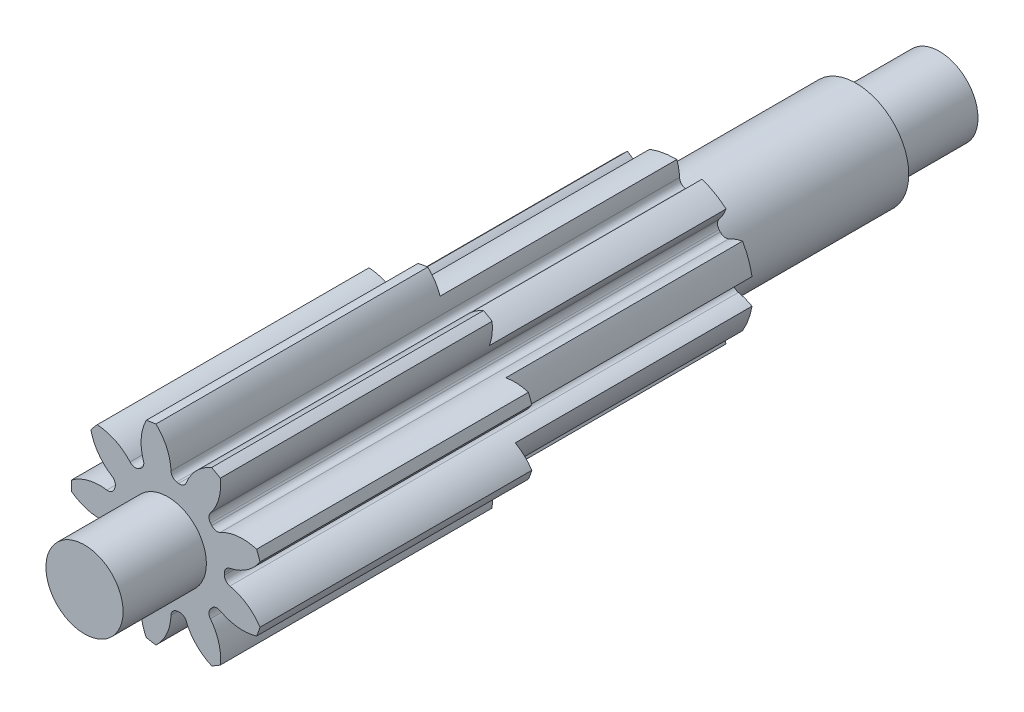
from build123d import *

# Parameters (mm, degrees)
BOSS_EXTRUDE1_DEPTH      = 4.875
BOSS_EXTRUDE1_DEPTH_BACK = 4.875
SKETCH3_R                = 1.1
CUT_EXTRUDE1_DEPTH       = 6.11718917
FILLET1_R                = 0.078539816
CIRPATTERN1_COUNT        = 9
FILLET1_OF_CIRPATTERN1_R = 0.078539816
SKETCH5_W                = 0.95
SKETCH5_H                = 0.86


with BuildPart() as part:
    # Sketch3 → Boss-Extrude1 (new, two sides: drawn at the far end of the back side and taken through both)
    with BuildSketch(Plane.XY.offset(-BOSS_EXTRUDE1_DEPTH_BACK)):
        Circle(SKETCH3_R)
    extrude(amount=BOSS_EXTRUDE1_DEPTH + BOSS_EXTRUDE1_DEPTH_BACK)

    # Sketch4 → Cut-Extrude1 (cut, symmetric)
    with BuildSketch(Plane.XY):
        with BuildLine():
            Line((0.645237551, -0.078539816), (0.645237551, 0.078539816))
            ThreePointArc((0.645237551, 0.078539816), (0.876414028, 0.153933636), (1.051662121, 0.322500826))
            ThreePointArc((1.051662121, 0.322500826), (1.1, 0), (1.051662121, -0.322500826))
            ThreePointArc((1.051662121, -0.322500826), (0.876414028, -0.153933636), (0.645237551, -0.078539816))
        make_face()
    cut_extrude1 = extrude(amount=CUT_EXTRUDE1_DEPTH, both=True, mode=Mode.SUBTRACT)

    # Fillet1
    fillet1_edges = [part.edges().sort_by_distance(p)[0] for p in [
        (0.645237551, 0.078539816, 0),
        (0.645237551, -0.078539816, 0),
    ]]
    fillet(fillet1_edges, radius=FILLET1_R)

    # CirPattern1: Cut-Extrude1 ×9 about axis
    cirpattern1_axis = Axis((0, 0, 0), (0, 0, 1))
    for i in range(1, CIRPATTERN1_COUNT):
        add(cut_extrude1.rotate(cirpattern1_axis, i * 360 / CIRPATTERN1_COUNT), mode=Mode.SUBTRACT)

    # Fillet1 of CirPattern1
    fillet1_of_cirpattern1_edges = [part.edges().sort_by_distance(p)[0] for p in [
        (0.44379622, 0.474915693, 0),
        (0.544765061, 0.354585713, 0),
        (0.034697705, 0.649073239, 0),
        (0.189390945, 0.621796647, 0),
        (-0.390636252, 0.519522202, 0),
        (-0.254601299, 0.598062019, 0),
        (-0.633187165, 0.146880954, 0),
        (-0.579462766, 0.294487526, 0),
        (-0.579462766, -0.294487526, 0),
        (-0.633187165, -0.146880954, 0),
        (-0.254601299, -0.598062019, 0),
        (-0.390636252, -0.519522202, 0),
        (0.189390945, -0.621796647, 0),
        (0.034697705, -0.649073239, 0),
        (0.544765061, -0.354585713, 0),
        (0.44379622, -0.474915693, 0),
    ]]
    fillet(fillet1_of_cirpattern1_edges, radius=FILLET1_OF_CIRPATTERN1_R)

    # Sketch5 → Cut-Revolve1 (revolve, cut)
    with BuildSketch(Plane(origin=(0, 0, 0), x_dir=(0, 0, -1), z_dir=(1, 0, 0)), mode=Mode.PRIVATE) as cut_revolve1_sk:
        Polygon((4.875, 1.3), (4.875, 0.44), (3.925, 0.44), (3.925, 0.6), (1.875, 0.6), (1.875, 0.875), (-0.825, 0.875), (-0.825, 1.3), align=None)
        with Locations((-4.4, 0.87)):
            Rectangle(SKETCH5_W, SKETCH5_H)
    revolve(cut_revolve1_sk.sketch.rotate(Axis((0, 0, 4.875), (0, 0, -1)), 90), axis=Axis((0, 0, 4.875), (0, 0, -1)), mode=Mode.SUBTRACT)


solid = part.part
